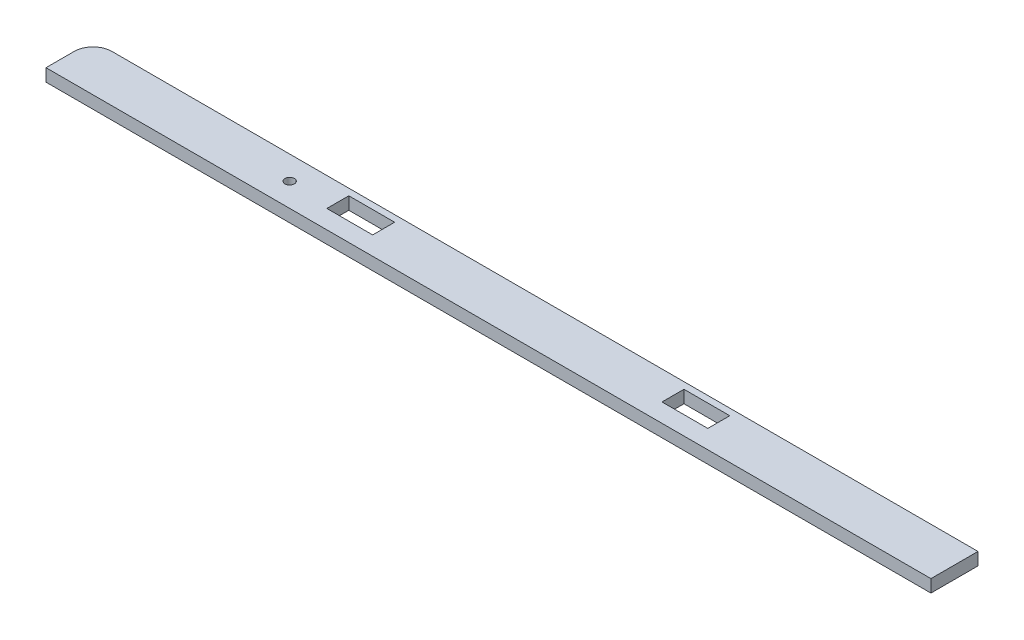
ISO-10303-21;
HEADER;
FILE_DESCRIPTION(('STEP AP214'),'2;1');
FILE_NAME('part.step','',(''),(''),'','','');
FILE_SCHEMA(('AUTOMOTIVE_DESIGN { 1 0 10303 214 1 1 1 1 }'));
ENDSEC;
DATA;
#1=APPLICATION_CONTEXT('core data for automotive mechanical design processes');
#2=APPLICATION_PROTOCOL_DEFINITION('international standard','automotive_design',2000,#1);
#3=PRODUCT_CONTEXT('',#1,'mechanical');
#4=PRODUCT('Part','Part','',(#3));
#5=PRODUCT_RELATED_PRODUCT_CATEGORY('part','',(#4));
#6=PRODUCT_DEFINITION_FORMATION('','',#4);
#7=PRODUCT_DEFINITION_CONTEXT('part definition',#1,'design');
#8=PRODUCT_DEFINITION('design','',#6,#7);
#9=PRODUCT_DEFINITION_SHAPE('','',#8);
#10=(LENGTH_UNIT() NAMED_UNIT(*) SI_UNIT(.MILLI.,.METRE.));
#11=(NAMED_UNIT(*) PLANE_ANGLE_UNIT() SI_UNIT($,.RADIAN.));
#12=(NAMED_UNIT(*) SI_UNIT($,.STERADIAN.) SOLID_ANGLE_UNIT());
#13=UNCERTAINTY_MEASURE_WITH_UNIT(LENGTH_MEASURE(1.E-05),#10,'distance_accuracy_value','');
#14=(GEOMETRIC_REPRESENTATION_CONTEXT(3) GLOBAL_UNCERTAINTY_ASSIGNED_CONTEXT((#13)) GLOBAL_UNIT_ASSIGNED_CONTEXT((#10,
#11,#12)) REPRESENTATION_CONTEXT('',''));
#15=CARTESIAN_POINT('',(0.,0.,0.));
#16=DIRECTION('',(0.,0.,1.));
#17=DIRECTION('',(1.,0.,0.));
#18=AXIS2_PLACEMENT_3D('',#15,#16,#17);
#19=CARTESIAN_POINT('',(151.,-1.,-121.));
#20=DIRECTION('',(0.,0.,-1.));
#21=DIRECTION('',(-1.,0.,0.));
#22=AXIS2_PLACEMENT_3D('',#19,#20,#21);
#23=PLANE('',#22);
#24=DIRECTION('',(-1.,0.,0.));
#25=VECTOR('',#24,1.);
#26=CARTESIAN_POINT('',(151.,3.,-121.));
#27=LINE('',#26,#25);
#28=CARTESIAN_POINT('',(141.,3.,-121.));
#29=VERTEX_POINT('',#28);
#30=CARTESIAN_POINT('',(-135.,3.,-121.));
#31=VERTEX_POINT('',#30);
#32=EDGE_CURVE('E141',#29,#31,#27,.T.);
#33=ORIENTED_EDGE('',*,*,#32,.F.);
#34=DIRECTION('',(0.,-1.,0.));
#35=VECTOR('',#34,1.);
#36=CARTESIAN_POINT('',(141.,10.,-121.));
#37=LINE('',#36,#35);
#38=CARTESIAN_POINT('',(141.,-0.999999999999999,-121.));
#39=VERTEX_POINT('',#38);
#40=EDGE_CURVE('E48',#29,#39,#37,.T.);
#41=ORIENTED_EDGE('',*,*,#40,.T.);
#42=DIRECTION('',(-1.,0.,0.));
#43=VECTOR('',#42,1.);
#44=CARTESIAN_POINT('',(151.,-1.,-121.));
#45=LINE('',#44,#43);
#46=CARTESIAN_POINT('',(-135.,-1.,-121.));
#47=VERTEX_POINT('',#46);
#48=EDGE_CURVE('E139',#39,#47,#45,.T.);
#49=ORIENTED_EDGE('',*,*,#48,.T.);
#50=DIRECTION('',(0.,1.,0.));
#51=VECTOR('',#50,1.);
#52=CARTESIAN_POINT('',(-135.,-1.,-121.));
#53=LINE('',#52,#51);
#54=EDGE_CURVE('E166',#47,#31,#53,.T.);
#55=ORIENTED_EDGE('',*,*,#54,.T.);
#56=EDGE_LOOP('',(#33,#41,#49,#55));
#57=FACE_BOUND('',#56,.T.);
#58=ADVANCED_FACE('F33',(#57),#23,.T.);
#59=CARTESIAN_POINT('',(-141.,-1.,-106.));
#60=DIRECTION('',(0.,0.,1.));
#61=DIRECTION('',(1.,0.,0.));
#62=AXIS2_PLACEMENT_3D('',#59,#60,#61);
#63=PLANE('',#62);
#64=DIRECTION('',(1.,0.,0.));
#65=VECTOR('',#64,1.);
#66=CARTESIAN_POINT('',(-141.,-1.,-106.));
#67=LINE('',#66,#65);
#68=CARTESIAN_POINT('',(-141.,-1.,-106.));
#69=VERTEX_POINT('',#68);
#70=CARTESIAN_POINT('',(141.,-0.999999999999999,-106.));
#71=VERTEX_POINT('',#70);
#72=EDGE_CURVE('E146',#69,#71,#67,.T.);
#73=ORIENTED_EDGE('',*,*,#72,.T.);
#74=DIRECTION('',(0.,-1.,0.));
#75=VECTOR('',#74,1.);
#76=CARTESIAN_POINT('',(141.,10.,-106.));
#77=LINE('',#76,#75);
#78=CARTESIAN_POINT('',(141.,3.,-106.));
#79=VERTEX_POINT('',#78);
#80=EDGE_CURVE('E129',#79,#71,#77,.T.);
#81=ORIENTED_EDGE('',*,*,#80,.F.);
#82=DIRECTION('',(1.,0.,0.));
#83=VECTOR('',#82,1.);
#84=CARTESIAN_POINT('',(-141.,3.,-106.));
#85=LINE('',#84,#83);
#86=CARTESIAN_POINT('',(-141.,3.,-106.));
#87=VERTEX_POINT('',#86);
#88=EDGE_CURVE('E157',#87,#79,#85,.T.);
#89=ORIENTED_EDGE('',*,*,#88,.F.);
#90=DIRECTION('',(0.,1.,0.));
#91=VECTOR('',#90,1.);
#92=CARTESIAN_POINT('',(-141.,-1.,-106.));
#93=LINE('',#92,#91);
#94=EDGE_CURVE('E147',#69,#87,#93,.T.);
#95=ORIENTED_EDGE('',*,*,#94,.F.);
#96=EDGE_LOOP('',(#73,#81,#89,#95));
#97=FACE_BOUND('',#96,.T.);
#98=ADVANCED_FACE('F218',(#97),#63,.T.);
#99=CARTESIAN_POINT('',(0.,-1.,0.));
#100=DIRECTION('',(0.,1.,0.));
#101=DIRECTION('',(0.,0.,1.));
#102=AXIS2_PLACEMENT_3D('',#99,#100,#101);
#103=PLANE('',#102);
#104=CARTESIAN_POINT('',(-70.85,-1.,-113.5));
#105=DIRECTION('',(0.,1.,0.));
#106=DIRECTION('',(0.,0.,1.));
#107=AXIS2_PLACEMENT_3D('',#104,#105,#106);
#108=CIRCLE('',#107,1.5);
#109=CARTESIAN_POINT('',(-70.85,-1.,-112.));
#110=VERTEX_POINT('',#109);
#111=EDGE_CURVE('E158',#110,#110,#108,.T.);
#112=ORIENTED_EDGE('',*,*,#111,.T.);
#113=EDGE_LOOP('',(#112));
#114=FACE_BOUND('',#113,.T.);
#115=DIRECTION('',(-1.,0.,0.));
#116=VECTOR('',#115,1.);
#117=CARTESIAN_POINT('',(49.3999999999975,-1.,-118.900000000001));
#118=LINE('',#117,#116);
#119=CARTESIAN_POINT('',(63.9999999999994,-1.,-118.900000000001));
#120=VERTEX_POINT('',#119);
#121=CARTESIAN_POINT('',(49.3999999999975,-1.,-118.900000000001));
#122=VERTEX_POINT('',#121);
#123=EDGE_CURVE('E191',#120,#122,#118,.T.);
#124=ORIENTED_EDGE('',*,*,#123,.T.);
#125=DIRECTION('',(0.,0.,1.));
#126=VECTOR('',#125,1.);
#127=CARTESIAN_POINT('',(49.3999999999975,-1.,-118.900000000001));
#128=LINE('',#127,#126);
#129=CARTESIAN_POINT('',(49.3999999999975,-1.,-111.900000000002));
#130=VERTEX_POINT('',#129);
#131=EDGE_CURVE('E268',#122,#130,#128,.T.);
#132=ORIENTED_EDGE('',*,*,#131,.T.);
#133=DIRECTION('',(1.,0.,0.));
#134=VECTOR('',#133,1.);
#135=CARTESIAN_POINT('',(49.3999999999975,-1.,-111.900000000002));
#136=LINE('',#135,#134);
#137=CARTESIAN_POINT('',(63.9999999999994,-1.,-111.900000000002));
#138=VERTEX_POINT('',#137);
#139=EDGE_CURVE('E272',#130,#138,#136,.T.);
#140=ORIENTED_EDGE('',*,*,#139,.T.);
#141=DIRECTION('',(0.,0.,-1.));
#142=VECTOR('',#141,1.);
#143=CARTESIAN_POINT('',(63.9999999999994,-1.,-118.900000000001));
#144=LINE('',#143,#142);
#145=EDGE_CURVE('E269',#138,#120,#144,.T.);
#146=ORIENTED_EDGE('',*,*,#145,.T.);
#147=EDGE_LOOP('',(#124,#132,#140,#146));
#148=FACE_BOUND('',#147,.T.);
#149=DIRECTION('',(-1.,0.,0.));
#150=VECTOR('',#149,1.);
#151=CARTESIAN_POINT('',(-57.4000000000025,-1.,-118.900000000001));
#152=LINE('',#151,#150);
#153=CARTESIAN_POINT('',(-42.8000000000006,-1.,-118.900000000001));
#154=VERTEX_POINT('',#153);
#155=CARTESIAN_POINT('',(-57.4000000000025,-1.,-118.900000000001));
#156=VERTEX_POINT('',#155);
#157=EDGE_CURVE('E149',#154,#156,#152,.T.);
#158=ORIENTED_EDGE('',*,*,#157,.T.);
#159=DIRECTION('',(0.,0.,1.));
#160=VECTOR('',#159,1.);
#161=CARTESIAN_POINT('',(-57.4000000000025,-1.,-118.900000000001));
#162=LINE('',#161,#160);
#163=CARTESIAN_POINT('',(-57.4000000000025,-1.,-111.900000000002));
#164=VERTEX_POINT('',#163);
#165=EDGE_CURVE('E187',#156,#164,#162,.T.);
#166=ORIENTED_EDGE('',*,*,#165,.T.);
#167=DIRECTION('',(1.,0.,0.));
#168=VECTOR('',#167,1.);
#169=CARTESIAN_POINT('',(-57.4000000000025,-1.,-111.900000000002));
#170=LINE('',#169,#168);
#171=CARTESIAN_POINT('',(-42.8000000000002,-1.,-111.9));
#172=VERTEX_POINT('',#171);
#173=EDGE_CURVE('E192',#164,#172,#170,.T.);
#174=ORIENTED_EDGE('',*,*,#173,.T.);
#175=DIRECTION('',(0.,0.,-1.));
#176=VECTOR('',#175,1.);
#177=CARTESIAN_POINT('',(-42.8000000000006,-1.,-118.900000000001));
#178=LINE('',#177,#176);
#179=EDGE_CURVE('E188',#172,#154,#178,.T.);
#180=ORIENTED_EDGE('',*,*,#179,.T.);
#181=EDGE_LOOP('',(#158,#166,#174,#180));
#182=FACE_BOUND('',#181,.T.);
#183=DIRECTION('',(0.,0.,-1.));
#184=VECTOR('',#183,1.);
#185=CARTESIAN_POINT('',(141.,-1.,0.));
#186=LINE('',#185,#184);
#187=EDGE_CURVE('E126',#71,#39,#186,.T.);
#188=ORIENTED_EDGE('',*,*,#187,.F.);
#189=ORIENTED_EDGE('',*,*,#72,.F.);
#190=DIRECTION('',(0.,0.,1.));
#191=VECTOR('',#190,1.);
#192=CARTESIAN_POINT('',(-141.,-1.,-121.));
#193=LINE('',#192,#191);
#194=CARTESIAN_POINT('',(-141.,-1.,-115.));
#195=VERTEX_POINT('',#194);
#196=EDGE_CURVE('E134',#195,#69,#193,.T.);
#197=ORIENTED_EDGE('',*,*,#196,.F.);
#198=CARTESIAN_POINT('',(-135.,-1.,-115.));
#199=DIRECTION('',(0.,1.,0.));
#200=DIRECTION('',(0.,0.,1.));
#201=AXIS2_PLACEMENT_3D('',#198,#199,#200);
#202=CIRCLE('',#201,6.);
#203=EDGE_CURVE('E41',#195,#47,#202,.F.);
#204=ORIENTED_EDGE('',*,*,#203,.T.);
#205=ORIENTED_EDGE('',*,*,#48,.F.);
#206=EDGE_LOOP('',(#188,#189,#197,#204,#205));
#207=FACE_BOUND('',#206,.T.);
#208=ADVANCED_FACE('F143',(#114,#148,#182,#207),#103,.F.);
#209=CARTESIAN_POINT('',(0.,3.,0.));
#210=DIRECTION('',(0.,1.,0.));
#211=DIRECTION('',(0.,0.,1.));
#212=AXIS2_PLACEMENT_3D('',#209,#210,#211);
#213=PLANE('',#212);
#214=CARTESIAN_POINT('',(-70.85,3.,-113.5));
#215=DIRECTION('',(0.,1.,0.));
#216=DIRECTION('',(0.,0.,1.));
#217=AXIS2_PLACEMENT_3D('',#214,#215,#216);
#218=CIRCLE('',#217,1.5);
#219=CARTESIAN_POINT('',(-70.85,3.,-112.));
#220=VERTEX_POINT('',#219);
#221=EDGE_CURVE('E161',#220,#220,#218,.T.);
#222=ORIENTED_EDGE('',*,*,#221,.F.);
#223=EDGE_LOOP('',(#222));
#224=FACE_BOUND('',#223,.T.);
#225=DIRECTION('',(0.,0.,1.));
#226=VECTOR('',#225,1.);
#227=CARTESIAN_POINT('',(49.3999999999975,3.,-118.900000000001));
#228=LINE('',#227,#226);
#229=CARTESIAN_POINT('',(49.3999999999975,3.,-118.900000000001));
#230=VERTEX_POINT('',#229);
#231=CARTESIAN_POINT('',(49.3999999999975,3.,-111.900000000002));
#232=VERTEX_POINT('',#231);
#233=EDGE_CURVE('E277',#230,#232,#228,.T.);
#234=ORIENTED_EDGE('',*,*,#233,.F.);
#235=DIRECTION('',(-1.,0.,0.));
#236=VECTOR('',#235,1.);
#237=CARTESIAN_POINT('',(49.3999999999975,3.,-118.900000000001));
#238=LINE('',#237,#236);
#239=CARTESIAN_POINT('',(63.9999999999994,3.,-118.900000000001));
#240=VERTEX_POINT('',#239);
#241=EDGE_CURVE('E288',#240,#230,#238,.T.);
#242=ORIENTED_EDGE('',*,*,#241,.F.);
#243=DIRECTION('',(0.,0.,-1.));
#244=VECTOR('',#243,1.);
#245=CARTESIAN_POINT('',(63.9999999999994,3.,-118.900000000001));
#246=LINE('',#245,#244);
#247=CARTESIAN_POINT('',(63.9999999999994,3.,-111.900000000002));
#248=VERTEX_POINT('',#247);
#249=EDGE_CURVE('E284',#248,#240,#246,.T.);
#250=ORIENTED_EDGE('',*,*,#249,.F.);
#251=DIRECTION('',(1.,0.,0.));
#252=VECTOR('',#251,1.);
#253=CARTESIAN_POINT('',(49.3999999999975,3.,-111.900000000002));
#254=LINE('',#253,#252);
#255=EDGE_CURVE('E280',#232,#248,#254,.T.);
#256=ORIENTED_EDGE('',*,*,#255,.F.);
#257=EDGE_LOOP('',(#234,#242,#250,#256));
#258=FACE_BOUND('',#257,.T.);
#259=DIRECTION('',(0.,0.,1.));
#260=VECTOR('',#259,1.);
#261=CARTESIAN_POINT('',(-57.4000000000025,3.,-118.900000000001));
#262=LINE('',#261,#260);
#263=CARTESIAN_POINT('',(-57.4000000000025,3.,-118.900000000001));
#264=VERTEX_POINT('',#263);
#265=CARTESIAN_POINT('',(-57.4000000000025,3.,-111.900000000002));
#266=VERTEX_POINT('',#265);
#267=EDGE_CURVE('E176',#264,#266,#262,.T.);
#268=ORIENTED_EDGE('',*,*,#267,.F.);
#269=DIRECTION('',(-1.,0.,0.));
#270=VECTOR('',#269,1.);
#271=CARTESIAN_POINT('',(-57.4000000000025,3.,-118.900000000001));
#272=LINE('',#271,#270);
#273=CARTESIAN_POINT('',(-42.8000000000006,3.,-118.900000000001));
#274=VERTEX_POINT('',#273);
#275=EDGE_CURVE('E173',#274,#264,#272,.T.);
#276=ORIENTED_EDGE('',*,*,#275,.F.);
#277=DIRECTION('',(0.,0.,-1.));
#278=VECTOR('',#277,1.);
#279=CARTESIAN_POINT('',(-42.8000000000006,3.,-118.900000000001));
#280=LINE('',#279,#278);
#281=CARTESIAN_POINT('',(-42.8000000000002,3.,-111.9));
#282=VERTEX_POINT('',#281);
#283=EDGE_CURVE('E170',#282,#274,#280,.T.);
#284=ORIENTED_EDGE('',*,*,#283,.F.);
#285=DIRECTION('',(1.,0.,0.));
#286=VECTOR('',#285,1.);
#287=CARTESIAN_POINT('',(-57.4000000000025,3.,-111.900000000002));
#288=LINE('',#287,#286);
#289=EDGE_CURVE('E167',#266,#282,#288,.T.);
#290=ORIENTED_EDGE('',*,*,#289,.F.);
#291=EDGE_LOOP('',(#268,#276,#284,#290));
#292=FACE_BOUND('',#291,.T.);
#293=ORIENTED_EDGE('',*,*,#88,.T.);
#294=DIRECTION('',(0.,0.,-1.));
#295=VECTOR('',#294,1.);
#296=CARTESIAN_POINT('',(141.,3.,0.));
#297=LINE('',#296,#295);
#298=EDGE_CURVE('E11',#79,#29,#297,.T.);
#299=ORIENTED_EDGE('',*,*,#298,.T.);
#300=ORIENTED_EDGE('',*,*,#32,.T.);
#301=CARTESIAN_POINT('',(-135.,3.,-115.));
#302=DIRECTION('',(0.,1.,0.));
#303=DIRECTION('',(0.,0.,1.));
#304=AXIS2_PLACEMENT_3D('',#301,#302,#303);
#305=CIRCLE('',#304,6.);
#306=CARTESIAN_POINT('',(-141.,3.,-115.));
#307=VERTEX_POINT('',#306);
#308=EDGE_CURVE('E198',#31,#307,#305,.T.);
#309=ORIENTED_EDGE('',*,*,#308,.T.);
#310=DIRECTION('',(0.,0.,1.));
#311=VECTOR('',#310,1.);
#312=CARTESIAN_POINT('',(-141.,3.,-121.));
#313=LINE('',#312,#311);
#314=EDGE_CURVE('E155',#307,#87,#313,.T.);
#315=ORIENTED_EDGE('',*,*,#314,.T.);
#316=EDGE_LOOP('',(#293,#299,#300,#309,#315));
#317=FACE_BOUND('',#316,.T.);
#318=ADVANCED_FACE('F202',(#224,#258,#292,#317),#213,.T.);
#319=CARTESIAN_POINT('',(-141.,-1.,-121.));
#320=DIRECTION('',(-1.,0.,0.));
#321=DIRECTION('',(0.,0.,1.));
#322=AXIS2_PLACEMENT_3D('',#319,#320,#321);
#323=PLANE('',#322);
#324=ORIENTED_EDGE('',*,*,#314,.F.);
#325=DIRECTION('',(0.,1.,0.));
#326=VECTOR('',#325,1.);
#327=CARTESIAN_POINT('',(-141.,-1.,-115.));
#328=LINE('',#327,#326);
#329=EDGE_CURVE('E55',#307,#195,#328,.F.);
#330=ORIENTED_EDGE('',*,*,#329,.T.);
#331=ORIENTED_EDGE('',*,*,#196,.T.);
#332=ORIENTED_EDGE('',*,*,#94,.T.);
#333=EDGE_LOOP('',(#324,#330,#331,#332));
#334=FACE_BOUND('',#333,.T.);
#335=ADVANCED_FACE('F204',(#334),#323,.T.);
#336=CARTESIAN_POINT('',(-70.85,-1.,-113.5));
#337=DIRECTION('',(0.,1.,0.));
#338=DIRECTION('',(0.,0.,1.));
#339=AXIS2_PLACEMENT_3D('',#336,#337,#338);
#340=CYLINDRICAL_SURFACE('',#339,1.5);
#341=ORIENTED_EDGE('',*,*,#111,.F.);
#342=EDGE_LOOP('',(#341));
#343=FACE_BOUND('',#342,.T.);
#344=ORIENTED_EDGE('',*,*,#221,.T.);
#345=EDGE_LOOP('',(#344));
#346=FACE_BOUND('',#345,.T.);
#347=ADVANCED_FACE('F226',(#343,#346),#340,.F.);
#348=CARTESIAN_POINT('',(49.3999999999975,-1.,-118.900000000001));
#349=DIRECTION('',(-1.,0.,0.));
#350=DIRECTION('',(0.,0.,1.));
#351=AXIS2_PLACEMENT_3D('',#348,#349,#350);
#352=PLANE('',#351);
#353=ORIENTED_EDGE('',*,*,#233,.T.);
#354=DIRECTION('',(0.,1.,0.));
#355=VECTOR('',#354,1.);
#356=CARTESIAN_POINT('',(49.3999999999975,-1.,-111.900000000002));
#357=LINE('',#356,#355);
#358=EDGE_CURVE('E184',#130,#232,#357,.T.);
#359=ORIENTED_EDGE('',*,*,#358,.F.);
#360=ORIENTED_EDGE('',*,*,#131,.F.);
#361=DIRECTION('',(0.,1.,0.));
#362=VECTOR('',#361,1.);
#363=CARTESIAN_POINT('',(49.3999999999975,-1.,-118.900000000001));
#364=LINE('',#363,#362);
#365=EDGE_CURVE('E279',#122,#230,#364,.T.);
#366=ORIENTED_EDGE('',*,*,#365,.T.);
#367=EDGE_LOOP('',(#353,#359,#360,#366));
#368=FACE_BOUND('',#367,.T.);
#369=ADVANCED_FACE('F311',(#368),#352,.F.);
#370=CARTESIAN_POINT('',(49.3999999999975,-1.,-118.900000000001));
#371=DIRECTION('',(0.,0.,-1.));
#372=DIRECTION('',(-1.,0.,0.));
#373=AXIS2_PLACEMENT_3D('',#370,#371,#372);
#374=PLANE('',#373);
#375=ORIENTED_EDGE('',*,*,#241,.T.);
#376=ORIENTED_EDGE('',*,*,#365,.F.);
#377=ORIENTED_EDGE('',*,*,#123,.F.);
#378=DIRECTION('',(0.,1.,0.));
#379=VECTOR('',#378,1.);
#380=CARTESIAN_POINT('',(63.9999999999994,-1.,-118.900000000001));
#381=LINE('',#380,#379);
#382=EDGE_CURVE('E287',#120,#240,#381,.T.);
#383=ORIENTED_EDGE('',*,*,#382,.T.);
#384=EDGE_LOOP('',(#375,#376,#377,#383));
#385=FACE_BOUND('',#384,.T.);
#386=ADVANCED_FACE('F307',(#385),#374,.F.);
#387=CARTESIAN_POINT('',(63.9999999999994,-1.,-118.900000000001));
#388=DIRECTION('',(1.,0.,0.));
#389=DIRECTION('',(0.,0.,-1.));
#390=AXIS2_PLACEMENT_3D('',#387,#388,#389);
#391=PLANE('',#390);
#392=ORIENTED_EDGE('',*,*,#249,.T.);
#393=ORIENTED_EDGE('',*,*,#382,.F.);
#394=ORIENTED_EDGE('',*,*,#145,.F.);
#395=DIRECTION('',(0.,1.,0.));
#396=VECTOR('',#395,1.);
#397=CARTESIAN_POINT('',(63.9999999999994,-1.,-111.900000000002));
#398=LINE('',#397,#396);
#399=EDGE_CURVE('E283',#138,#248,#398,.T.);
#400=ORIENTED_EDGE('',*,*,#399,.T.);
#401=EDGE_LOOP('',(#392,#393,#394,#400));
#402=FACE_BOUND('',#401,.T.);
#403=ADVANCED_FACE('F305',(#402),#391,.F.);
#404=CARTESIAN_POINT('',(49.3999999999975,-1.,-111.900000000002));
#405=DIRECTION('',(0.,0.,1.));
#406=DIRECTION('',(1.,0.,0.));
#407=AXIS2_PLACEMENT_3D('',#404,#405,#406);
#408=PLANE('',#407);
#409=ORIENTED_EDGE('',*,*,#255,.T.);
#410=ORIENTED_EDGE('',*,*,#399,.F.);
#411=ORIENTED_EDGE('',*,*,#139,.F.);
#412=ORIENTED_EDGE('',*,*,#358,.T.);
#413=EDGE_LOOP('',(#409,#410,#411,#412));
#414=FACE_BOUND('',#413,.T.);
#415=ADVANCED_FACE('F234',(#414),#408,.F.);
#416=CARTESIAN_POINT('',(-57.4000000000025,-1.,-118.900000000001));
#417=DIRECTION('',(-1.,0.,0.));
#418=DIRECTION('',(0.,0.,1.));
#419=AXIS2_PLACEMENT_3D('',#416,#417,#418);
#420=PLANE('',#419);
#421=ORIENTED_EDGE('',*,*,#267,.T.);
#422=DIRECTION('',(0.,1.,0.));
#423=VECTOR('',#422,1.);
#424=CARTESIAN_POINT('',(-57.4000000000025,-1.,-111.900000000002));
#425=LINE('',#424,#423);
#426=EDGE_CURVE('E163',#164,#266,#425,.T.);
#427=ORIENTED_EDGE('',*,*,#426,.F.);
#428=ORIENTED_EDGE('',*,*,#165,.F.);
#429=DIRECTION('',(0.,1.,0.));
#430=VECTOR('',#429,1.);
#431=CARTESIAN_POINT('',(-57.4000000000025,-1.,-118.900000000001));
#432=LINE('',#431,#430);
#433=EDGE_CURVE('E174',#156,#264,#432,.T.);
#434=ORIENTED_EDGE('',*,*,#433,.T.);
#435=EDGE_LOOP('',(#421,#427,#428,#434));
#436=FACE_BOUND('',#435,.T.);
#437=ADVANCED_FACE('F231',(#436),#420,.F.);
#438=CARTESIAN_POINT('',(-57.4000000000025,-1.,-118.900000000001));
#439=DIRECTION('',(0.,0.,-1.));
#440=DIRECTION('',(-1.,0.,0.));
#441=AXIS2_PLACEMENT_3D('',#438,#439,#440);
#442=PLANE('',#441);
#443=ORIENTED_EDGE('',*,*,#275,.T.);
#444=ORIENTED_EDGE('',*,*,#433,.F.);
#445=ORIENTED_EDGE('',*,*,#157,.F.);
#446=DIRECTION('',(0.,1.,0.));
#447=VECTOR('',#446,1.);
#448=CARTESIAN_POINT('',(-42.8000000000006,-1.,-118.900000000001));
#449=LINE('',#448,#447);
#450=EDGE_CURVE('E171',#154,#274,#449,.T.);
#451=ORIENTED_EDGE('',*,*,#450,.T.);
#452=EDGE_LOOP('',(#443,#444,#445,#451));
#453=FACE_BOUND('',#452,.T.);
#454=ADVANCED_FACE('F233',(#453),#442,.F.);
#455=CARTESIAN_POINT('',(-42.8000000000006,-1.,-118.900000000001));
#456=DIRECTION('',(1.,0.,0.));
#457=DIRECTION('',(0.,0.,-1.));
#458=AXIS2_PLACEMENT_3D('',#455,#456,#457);
#459=PLANE('',#458);
#460=ORIENTED_EDGE('',*,*,#283,.T.);
#461=ORIENTED_EDGE('',*,*,#450,.F.);
#462=ORIENTED_EDGE('',*,*,#179,.F.);
#463=DIRECTION('',(0.,1.,0.));
#464=VECTOR('',#463,1.);
#465=CARTESIAN_POINT('',(-42.8000000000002,-1.,-111.9));
#466=LINE('',#465,#464);
#467=EDGE_CURVE('E168',#172,#282,#466,.T.);
#468=ORIENTED_EDGE('',*,*,#467,.T.);
#469=EDGE_LOOP('',(#460,#461,#462,#468));
#470=FACE_BOUND('',#469,.T.);
#471=ADVANCED_FACE('F214',(#470),#459,.F.);
#472=CARTESIAN_POINT('',(-57.4000000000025,-1.,-111.900000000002));
#473=DIRECTION('',(0.,0.,1.));
#474=DIRECTION('',(1.,0.,0.));
#475=AXIS2_PLACEMENT_3D('',#472,#473,#474);
#476=PLANE('',#475);
#477=ORIENTED_EDGE('',*,*,#289,.T.);
#478=ORIENTED_EDGE('',*,*,#467,.F.);
#479=ORIENTED_EDGE('',*,*,#173,.F.);
#480=ORIENTED_EDGE('',*,*,#426,.T.);
#481=EDGE_LOOP('',(#477,#478,#479,#480));
#482=FACE_BOUND('',#481,.T.);
#483=ADVANCED_FACE('F208',(#482),#476,.F.);
#484=CARTESIAN_POINT('',(-135.,-1.,-115.));
#485=DIRECTION('',(0.,1.,0.));
#486=DIRECTION('',(0.,0.,1.));
#487=AXIS2_PLACEMENT_3D('',#484,#485,#486);
#488=CYLINDRICAL_SURFACE('',#487,6.);
#489=ORIENTED_EDGE('',*,*,#203,.F.);
#490=ORIENTED_EDGE('',*,*,#329,.F.);
#491=ORIENTED_EDGE('',*,*,#308,.F.);
#492=ORIENTED_EDGE('',*,*,#54,.F.);
#493=EDGE_LOOP('',(#489,#490,#491,#492));
#494=FACE_BOUND('',#493,.T.);
#495=ADVANCED_FACE('F35',(#494),#488,.T.);
#496=CARTESIAN_POINT('',(141.,10.,-106.));
#497=DIRECTION('',(1.,0.,0.));
#498=DIRECTION('',(0.,0.,-1.));
#499=AXIS2_PLACEMENT_3D('',#496,#497,#498);
#500=PLANE('',#499);
#501=ORIENTED_EDGE('',*,*,#187,.T.);
#502=ORIENTED_EDGE('',*,*,#40,.F.);
#503=ORIENTED_EDGE('',*,*,#298,.F.);
#504=ORIENTED_EDGE('',*,*,#80,.T.);
#505=EDGE_LOOP('',(#501,#502,#503,#504));
#506=FACE_BOUND('',#505,.T.);
#507=ADVANCED_FACE('F127',(#506),#500,.T.);
#508=CLOSED_SHELL('',(#58,#98,#208,#318,#335,#347,#369,#386,#403,#415,#437,#454,#471,#483,#495,#507));
#509=MANIFOLD_SOLID_BREP('B2',#508);
#510=ADVANCED_BREP_SHAPE_REPRESENTATION('',(#18,#509),#14);
#511=SHAPE_DEFINITION_REPRESENTATION(#9,#510);
ENDSEC;
END-ISO-10303-21;
